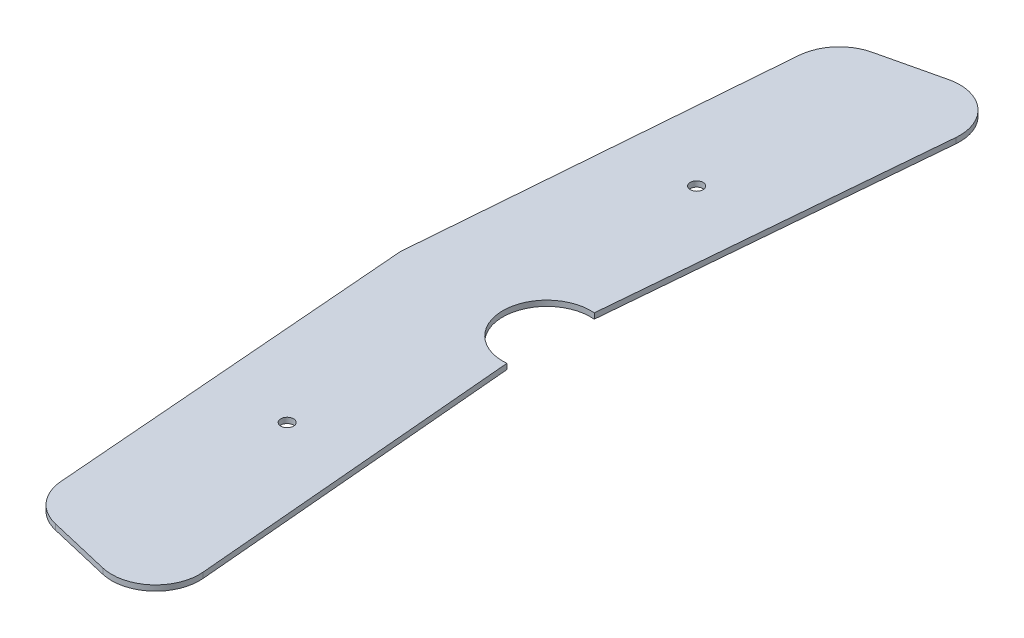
ISO-10303-21;
HEADER;
FILE_DESCRIPTION(('STEP AP214'),'2;1');
FILE_NAME('part.step','',(''),(''),'','','');
FILE_SCHEMA(('AUTOMOTIVE_DESIGN { 1 0 10303 214 1 1 1 1 }'));
ENDSEC;
DATA;
#1=APPLICATION_CONTEXT('core data for automotive mechanical design processes');
#2=APPLICATION_PROTOCOL_DEFINITION('international standard','automotive_design',2000,#1);
#3=PRODUCT_CONTEXT('',#1,'mechanical');
#4=PRODUCT('Part','Part','',(#3));
#5=PRODUCT_RELATED_PRODUCT_CATEGORY('part','',(#4));
#6=PRODUCT_DEFINITION_FORMATION('','',#4);
#7=PRODUCT_DEFINITION_CONTEXT('part definition',#1,'design');
#8=PRODUCT_DEFINITION('design','',#6,#7);
#9=PRODUCT_DEFINITION_SHAPE('','',#8);
#10=(LENGTH_UNIT() NAMED_UNIT(*) SI_UNIT(.MILLI.,.METRE.));
#11=(NAMED_UNIT(*) PLANE_ANGLE_UNIT() SI_UNIT($,.RADIAN.));
#12=(NAMED_UNIT(*) SI_UNIT($,.STERADIAN.) SOLID_ANGLE_UNIT());
#13=UNCERTAINTY_MEASURE_WITH_UNIT(LENGTH_MEASURE(1.E-05),#10,'distance_accuracy_value','');
#14=(GEOMETRIC_REPRESENTATION_CONTEXT(3) GLOBAL_UNCERTAINTY_ASSIGNED_CONTEXT((#13)) GLOBAL_UNIT_ASSIGNED_CONTEXT((#10,
#11,#12)) REPRESENTATION_CONTEXT('',''));
#15=CARTESIAN_POINT('',(0.,0.,0.));
#16=DIRECTION('',(0.,0.,1.));
#17=DIRECTION('',(1.,0.,0.));
#18=AXIS2_PLACEMENT_3D('',#15,#16,#17);
#19=CARTESIAN_POINT('',(20.,1.5,100.));
#20=DIRECTION('',(0.,-1.,0.));
#21=DIRECTION('',(0.,0.,-1.));
#22=AXIS2_PLACEMENT_3D('',#19,#20,#21);
#23=PLANE('',#22);
#24=CARTESIAN_POINT('',(25.,1.5,-56.));
#25=DIRECTION('',(0.,1.,0.));
#26=DIRECTION('',(0.,0.,1.));
#27=AXIS2_PLACEMENT_3D('',#24,#25,#26);
#28=CIRCLE('',#27,1.75);
#29=CARTESIAN_POINT('',(25.,1.5,-54.25));
#30=VERTEX_POINT('',#29);
#31=EDGE_CURVE('E132',#30,#30,#28,.T.);
#32=ORIENTED_EDGE('',*,*,#31,.F.);
#33=EDGE_LOOP('',(#32));
#34=FACE_BOUND('',#33,.T.);
#35=DIRECTION('',(0.0793688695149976,0.,0.996845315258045));
#36=VECTOR('',#35,1.);
#37=CARTESIAN_POINT('',(0.,1.5,0.));
#38=LINE('',#37,#36);
#39=CARTESIAN_POINT('',(0.,1.5,0.));
#40=VERTEX_POINT('',#39);
#41=CARTESIAN_POINT('',(8.03783692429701,1.5,100.952427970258));
#42=VERTEX_POINT('',#41);
#43=EDGE_CURVE('E156',#40,#42,#38,.T.);
#44=ORIENTED_EDGE('',*,*,#43,.T.);
#45=CARTESIAN_POINT('',(20.,1.5,100.));
#46=DIRECTION('',(0.,1.,0.));
#47=DIRECTION('',(0.,0.,-1.));
#48=AXIS2_PLACEMENT_3D('',#45,#46,#47);
#49=CIRCLE('',#48,12.0000193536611);
#50=CARTESIAN_POINT('',(17.2515962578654,1.5,111.681041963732));
#51=VERTEX_POINT('',#50);
#52=EDGE_CURVE('E127',#42,#51,#49,.T.);
#53=ORIENTED_EDGE('',*,*,#52,.T.);
#54=DIRECTION('',(0.973418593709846,0.,0.229033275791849));
#55=VECTOR('',#54,1.);
#56=CARTESIAN_POINT('',(17.2515962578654,1.5,111.681041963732));
#57=LINE('',#56,#55);
#58=CARTESIAN_POINT('',(34.2516211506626,1.5,115.680936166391));
#59=VERTEX_POINT('',#58);
#60=EDGE_CURVE('E159',#51,#59,#57,.T.);
#61=ORIENTED_EDGE('',*,*,#60,.T.);
#62=CARTESIAN_POINT('',(37.,1.5,104.));
#63=DIRECTION('',(0.,1.,0.));
#64=DIRECTION('',(0.,0.,-1.));
#65=AXIS2_PLACEMENT_3D('',#62,#63,#64);
#66=CIRCLE('',#65,11.9999106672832);
#67=CARTESIAN_POINT('',(48.9547808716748,1.5,102.960254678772));
#68=VERTEX_POINT('',#67);
#69=EDGE_CURVE('E161',#59,#68,#66,.T.);
#70=ORIENTED_EDGE('',*,*,#69,.T.);
#71=DIRECTION('',(-0.0866460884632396,0.,-0.996239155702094));
#72=VECTOR('',#71,1.);
#73=CARTESIAN_POINT('',(41.0397530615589,1.5,11.9548698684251));
#74=LINE('',#73,#72);
#75=CARTESIAN_POINT('',(41.0397530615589,1.5,11.9548698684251));
#76=VERTEX_POINT('',#75);
#77=EDGE_CURVE('E163',#68,#76,#74,.T.);
#78=ORIENTED_EDGE('',*,*,#77,.T.);
#79=CARTESIAN_POINT('',(40.,1.5,0.));
#80=DIRECTION('',(0.,-1.,0.));
#81=DIRECTION('',(0.,0.,1.));
#82=AXIS2_PLACEMENT_3D('',#79,#80,#81);
#83=CIRCLE('',#82,12.);
#84=CARTESIAN_POINT('',(41.0397530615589,1.5,-11.9548698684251));
#85=VERTEX_POINT('',#84);
#86=EDGE_CURVE('E165',#76,#85,#83,.T.);
#87=ORIENTED_EDGE('',*,*,#86,.T.);
#88=DIRECTION('',(0.0866460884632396,0.,-0.996239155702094));
#89=VECTOR('',#88,1.);
#90=CARTESIAN_POINT('',(41.0397530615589,1.5,-11.9548698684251));
#91=LINE('',#90,#89);
#92=CARTESIAN_POINT('',(48.9547808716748,1.5,-102.960254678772));
#93=VERTEX_POINT('',#92);
#94=EDGE_CURVE('E167',#85,#93,#91,.T.);
#95=ORIENTED_EDGE('',*,*,#94,.T.);
#96=CARTESIAN_POINT('',(37.,1.5,-104.));
#97=DIRECTION('',(0.,1.,0.));
#98=DIRECTION('',(0.,0.,1.));
#99=AXIS2_PLACEMENT_3D('',#96,#97,#98);
#100=CIRCLE('',#99,11.9999106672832);
#101=CARTESIAN_POINT('',(34.2516211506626,1.5,-115.680936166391));
#102=VERTEX_POINT('',#101);
#103=EDGE_CURVE('E169',#93,#102,#100,.T.);
#104=ORIENTED_EDGE('',*,*,#103,.T.);
#105=DIRECTION('',(-0.973418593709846,0.,0.229033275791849));
#106=VECTOR('',#105,1.);
#107=CARTESIAN_POINT('',(17.2515962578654,1.5,-111.681041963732));
#108=LINE('',#107,#106);
#109=CARTESIAN_POINT('',(17.2515962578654,1.5,-111.681041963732));
#110=VERTEX_POINT('',#109);
#111=EDGE_CURVE('E171',#102,#110,#108,.T.);
#112=ORIENTED_EDGE('',*,*,#111,.T.);
#113=CARTESIAN_POINT('',(20.,1.5,-100.));
#114=DIRECTION('',(0.,1.,0.));
#115=DIRECTION('',(0.,0.,1.));
#116=AXIS2_PLACEMENT_3D('',#113,#114,#115);
#117=CIRCLE('',#116,12.0000193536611);
#118=CARTESIAN_POINT('',(8.03783692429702,1.5,-100.952427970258));
#119=VERTEX_POINT('',#118);
#120=EDGE_CURVE('E50',#110,#119,#117,.T.);
#121=ORIENTED_EDGE('',*,*,#120,.T.);
#122=DIRECTION('',(-0.0793688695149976,0.,0.996845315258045));
#123=VECTOR('',#122,1.);
#124=CARTESIAN_POINT('',(0.,1.5,0.));
#125=LINE('',#124,#123);
#126=EDGE_CURVE('E45',#119,#40,#125,.T.);
#127=ORIENTED_EDGE('',*,*,#126,.T.);
#128=EDGE_LOOP('',(#44,#53,#61,#70,#78,#87,#95,#104,#112,#121,#127));
#129=FACE_BOUND('',#128,.T.);
#130=CARTESIAN_POINT('',(25.,1.5,56.));
#131=DIRECTION('',(0.,1.,0.));
#132=DIRECTION('',(0.,0.,-1.));
#133=AXIS2_PLACEMENT_3D('',#130,#131,#132);
#134=CIRCLE('',#133,1.75);
#135=CARTESIAN_POINT('',(25.,1.5,54.25));
#136=VERTEX_POINT('',#135);
#137=EDGE_CURVE('E266',#136,#136,#134,.T.);
#138=ORIENTED_EDGE('',*,*,#137,.F.);
#139=EDGE_LOOP('',(#138));
#140=FACE_BOUND('',#139,.T.);
#141=ADVANCED_FACE('F30',(#34,#129,#140),#23,.F.);
#142=CARTESIAN_POINT('',(20.,0.,100.));
#143=DIRECTION('',(0.,-1.,0.));
#144=DIRECTION('',(0.,0.,-1.));
#145=AXIS2_PLACEMENT_3D('',#142,#143,#144);
#146=PLANE('',#145);
#147=CARTESIAN_POINT('',(25.,0.,-56.));
#148=DIRECTION('',(0.,1.,0.));
#149=DIRECTION('',(0.,0.,1.));
#150=AXIS2_PLACEMENT_3D('',#147,#148,#149);
#151=CIRCLE('',#150,1.75);
#152=CARTESIAN_POINT('',(25.,0.,-54.25));
#153=VERTEX_POINT('',#152);
#154=EDGE_CURVE('E135',#153,#153,#151,.T.);
#155=ORIENTED_EDGE('',*,*,#154,.T.);
#156=EDGE_LOOP('',(#155));
#157=FACE_BOUND('',#156,.T.);
#158=DIRECTION('',(0.0793688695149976,0.,0.996845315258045));
#159=VECTOR('',#158,1.);
#160=CARTESIAN_POINT('',(0.,0.,0.));
#161=LINE('',#160,#159);
#162=CARTESIAN_POINT('',(0.,0.,0.));
#163=VERTEX_POINT('',#162);
#164=CARTESIAN_POINT('',(8.03783692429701,0.,100.952427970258));
#165=VERTEX_POINT('',#164);
#166=EDGE_CURVE('E118',#163,#165,#161,.T.);
#167=ORIENTED_EDGE('',*,*,#166,.F.);
#168=DIRECTION('',(-0.0793688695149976,0.,0.996845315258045));
#169=VECTOR('',#168,1.);
#170=CARTESIAN_POINT('',(0.,0.,0.));
#171=LINE('',#170,#169);
#172=CARTESIAN_POINT('',(8.03783692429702,0.,-100.952427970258));
#173=VERTEX_POINT('',#172);
#174=EDGE_CURVE('E154',#173,#163,#171,.T.);
#175=ORIENTED_EDGE('',*,*,#174,.F.);
#176=CARTESIAN_POINT('',(20.,0.,-100.));
#177=DIRECTION('',(0.,1.,0.));
#178=DIRECTION('',(0.,0.,1.));
#179=AXIS2_PLACEMENT_3D('',#176,#177,#178);
#180=CIRCLE('',#179,12.0000193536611);
#181=CARTESIAN_POINT('',(17.2515962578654,0.,-111.681041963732));
#182=VERTEX_POINT('',#181);
#183=EDGE_CURVE('E152',#182,#173,#180,.T.);
#184=ORIENTED_EDGE('',*,*,#183,.F.);
#185=DIRECTION('',(-0.973418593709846,0.,0.229033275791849));
#186=VECTOR('',#185,1.);
#187=CARTESIAN_POINT('',(17.2515962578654,0.,-111.681041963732));
#188=LINE('',#187,#186);
#189=CARTESIAN_POINT('',(34.2516211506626,0.,-115.680936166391));
#190=VERTEX_POINT('',#189);
#191=EDGE_CURVE('E150',#190,#182,#188,.T.);
#192=ORIENTED_EDGE('',*,*,#191,.F.);
#193=CARTESIAN_POINT('',(37.,0.,-104.));
#194=DIRECTION('',(0.,1.,0.));
#195=DIRECTION('',(0.,0.,1.));
#196=AXIS2_PLACEMENT_3D('',#193,#194,#195);
#197=CIRCLE('',#196,11.9999106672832);
#198=CARTESIAN_POINT('',(48.9547808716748,0.,-102.960254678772));
#199=VERTEX_POINT('',#198);
#200=EDGE_CURVE('E148',#199,#190,#197,.T.);
#201=ORIENTED_EDGE('',*,*,#200,.F.);
#202=DIRECTION('',(0.0866460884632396,0.,-0.996239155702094));
#203=VECTOR('',#202,1.);
#204=CARTESIAN_POINT('',(41.0397530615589,0.,-11.9548698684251));
#205=LINE('',#204,#203);
#206=CARTESIAN_POINT('',(41.0397530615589,0.,-11.9548698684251));
#207=VERTEX_POINT('',#206);
#208=EDGE_CURVE('E146',#207,#199,#205,.T.);
#209=ORIENTED_EDGE('',*,*,#208,.F.);
#210=CARTESIAN_POINT('',(40.,0.,0.));
#211=DIRECTION('',(0.,-1.,0.));
#212=DIRECTION('',(0.,0.,1.));
#213=AXIS2_PLACEMENT_3D('',#210,#211,#212);
#214=CIRCLE('',#213,12.);
#215=CARTESIAN_POINT('',(41.0397530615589,0.,11.9548698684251));
#216=VERTEX_POINT('',#215);
#217=EDGE_CURVE('E144',#216,#207,#214,.T.);
#218=ORIENTED_EDGE('',*,*,#217,.F.);
#219=DIRECTION('',(-0.0866460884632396,0.,-0.996239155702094));
#220=VECTOR('',#219,1.);
#221=CARTESIAN_POINT('',(41.0397530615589,0.,11.9548698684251));
#222=LINE('',#221,#220);
#223=CARTESIAN_POINT('',(48.9547808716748,0.,102.960254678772));
#224=VERTEX_POINT('',#223);
#225=EDGE_CURVE('E142',#224,#216,#222,.T.);
#226=ORIENTED_EDGE('',*,*,#225,.F.);
#227=CARTESIAN_POINT('',(37.,0.,104.));
#228=DIRECTION('',(0.,1.,0.));
#229=DIRECTION('',(0.,0.,-1.));
#230=AXIS2_PLACEMENT_3D('',#227,#228,#229);
#231=CIRCLE('',#230,11.9999106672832);
#232=CARTESIAN_POINT('',(34.2516211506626,0.,115.680936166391));
#233=VERTEX_POINT('',#232);
#234=EDGE_CURVE('E140',#233,#224,#231,.T.);
#235=ORIENTED_EDGE('',*,*,#234,.F.);
#236=DIRECTION('',(0.973418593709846,0.,0.229033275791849));
#237=VECTOR('',#236,1.);
#238=CARTESIAN_POINT('',(17.2515962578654,0.,111.681041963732));
#239=LINE('',#238,#237);
#240=CARTESIAN_POINT('',(17.2515962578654,0.,111.681041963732));
#241=VERTEX_POINT('',#240);
#242=EDGE_CURVE('E120',#241,#233,#239,.T.);
#243=ORIENTED_EDGE('',*,*,#242,.F.);
#244=CARTESIAN_POINT('',(20.,0.,100.));
#245=DIRECTION('',(0.,1.,0.));
#246=DIRECTION('',(0.,0.,-1.));
#247=AXIS2_PLACEMENT_3D('',#244,#245,#246);
#248=CIRCLE('',#247,12.0000193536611);
#249=EDGE_CURVE('E113',#165,#241,#248,.T.);
#250=ORIENTED_EDGE('',*,*,#249,.F.);
#251=EDGE_LOOP('',(#167,#175,#184,#192,#201,#209,#218,#226,#235,#243,#250));
#252=FACE_BOUND('',#251,.T.);
#253=CARTESIAN_POINT('',(25.,0.,56.));
#254=DIRECTION('',(0.,1.,0.));
#255=DIRECTION('',(0.,0.,-1.));
#256=AXIS2_PLACEMENT_3D('',#253,#254,#255);
#257=CIRCLE('',#256,1.75);
#258=CARTESIAN_POINT('',(25.,0.,54.25));
#259=VERTEX_POINT('',#258);
#260=EDGE_CURVE('E269',#259,#259,#257,.T.);
#261=ORIENTED_EDGE('',*,*,#260,.T.);
#262=EDGE_LOOP('',(#261));
#263=FACE_BOUND('',#262,.T.);
#264=ADVANCED_FACE('F114',(#157,#252,#263),#146,.T.);
#265=CARTESIAN_POINT('',(0.,1.5,0.));
#266=DIRECTION('',(0.996845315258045,0.,-0.0793688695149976));
#267=DIRECTION('',(-0.0793688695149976,0.,-0.996845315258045));
#268=AXIS2_PLACEMENT_3D('',#265,#266,#267);
#269=PLANE('',#268);
#270=ORIENTED_EDGE('',*,*,#166,.T.);
#271=DIRECTION('',(0.,-1.,0.));
#272=VECTOR('',#271,1.);
#273=CARTESIAN_POINT('',(8.03783692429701,1.5,100.952427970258));
#274=LINE('',#273,#272);
#275=EDGE_CURVE('E11',#42,#165,#274,.T.);
#276=ORIENTED_EDGE('',*,*,#275,.F.);
#277=ORIENTED_EDGE('',*,*,#43,.F.);
#278=DIRECTION('',(0.,-1.,0.));
#279=VECTOR('',#278,1.);
#280=CARTESIAN_POINT('',(0.,1.5,0.));
#281=LINE('',#280,#279);
#282=EDGE_CURVE('E131',#40,#163,#281,.T.);
#283=ORIENTED_EDGE('',*,*,#282,.T.);
#284=EDGE_LOOP('',(#270,#276,#277,#283));
#285=FACE_BOUND('',#284,.T.);
#286=ADVANCED_FACE('F32',(#285),#269,.F.);
#287=CARTESIAN_POINT('',(20.,1.5,100.));
#288=DIRECTION('',(0.,-1.,0.));
#289=DIRECTION('',(0.,0.,-1.));
#290=AXIS2_PLACEMENT_3D('',#287,#288,#289);
#291=CYLINDRICAL_SURFACE('',#290,12.0000193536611);
#292=ORIENTED_EDGE('',*,*,#249,.T.);
#293=DIRECTION('',(0.,-1.,0.));
#294=VECTOR('',#293,1.);
#295=CARTESIAN_POINT('',(17.2515962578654,1.5,111.681041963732));
#296=LINE('',#295,#294);
#297=EDGE_CURVE('E38',#51,#241,#296,.T.);
#298=ORIENTED_EDGE('',*,*,#297,.F.);
#299=ORIENTED_EDGE('',*,*,#52,.F.);
#300=ORIENTED_EDGE('',*,*,#275,.T.);
#301=EDGE_LOOP('',(#292,#298,#299,#300));
#302=FACE_BOUND('',#301,.T.);
#303=ADVANCED_FACE('F126',(#302),#291,.T.);
#304=CARTESIAN_POINT('',(17.2515962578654,1.5,111.681041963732));
#305=DIRECTION('',(0.229033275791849,0.,-0.973418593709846));
#306=DIRECTION('',(-0.973418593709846,0.,-0.229033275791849));
#307=AXIS2_PLACEMENT_3D('',#304,#305,#306);
#308=PLANE('',#307);
#309=ORIENTED_EDGE('',*,*,#242,.T.);
#310=DIRECTION('',(0.,-1.,0.));
#311=VECTOR('',#310,1.);
#312=CARTESIAN_POINT('',(34.2516211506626,1.5,115.680936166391));
#313=LINE('',#312,#311);
#314=EDGE_CURVE('E197',#59,#233,#313,.T.);
#315=ORIENTED_EDGE('',*,*,#314,.F.);
#316=ORIENTED_EDGE('',*,*,#60,.F.);
#317=ORIENTED_EDGE('',*,*,#297,.T.);
#318=EDGE_LOOP('',(#309,#315,#316,#317));
#319=FACE_BOUND('',#318,.T.);
#320=ADVANCED_FACE('F201',(#319),#308,.F.);
#321=CARTESIAN_POINT('',(37.,1.5,104.));
#322=DIRECTION('',(0.,-1.,0.));
#323=DIRECTION('',(0.,0.,-1.));
#324=AXIS2_PLACEMENT_3D('',#321,#322,#323);
#325=CYLINDRICAL_SURFACE('',#324,11.9999106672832);
#326=ORIENTED_EDGE('',*,*,#234,.T.);
#327=DIRECTION('',(0.,-1.,0.));
#328=VECTOR('',#327,1.);
#329=CARTESIAN_POINT('',(48.9547808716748,1.5,102.960254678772));
#330=LINE('',#329,#328);
#331=EDGE_CURVE('E194',#68,#224,#330,.T.);
#332=ORIENTED_EDGE('',*,*,#331,.F.);
#333=ORIENTED_EDGE('',*,*,#69,.F.);
#334=ORIENTED_EDGE('',*,*,#314,.T.);
#335=EDGE_LOOP('',(#326,#332,#333,#334));
#336=FACE_BOUND('',#335,.T.);
#337=ADVANCED_FACE('F209',(#336),#325,.T.);
#338=CARTESIAN_POINT('',(41.0397530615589,1.5,11.9548698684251));
#339=DIRECTION('',(-0.996239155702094,0.,0.0866460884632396));
#340=DIRECTION('',(0.0866460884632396,0.,0.996239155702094));
#341=AXIS2_PLACEMENT_3D('',#338,#339,#340);
#342=PLANE('',#341);
#343=ORIENTED_EDGE('',*,*,#225,.T.);
#344=DIRECTION('',(0.,-1.,0.));
#345=VECTOR('',#344,1.);
#346=CARTESIAN_POINT('',(41.0397530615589,1.5,11.9548698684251));
#347=LINE('',#346,#345);
#348=EDGE_CURVE('E191',#76,#216,#347,.T.);
#349=ORIENTED_EDGE('',*,*,#348,.F.);
#350=ORIENTED_EDGE('',*,*,#77,.F.);
#351=ORIENTED_EDGE('',*,*,#331,.T.);
#352=EDGE_LOOP('',(#343,#349,#350,#351));
#353=FACE_BOUND('',#352,.T.);
#354=ADVANCED_FACE('F212',(#353),#342,.F.);
#355=CARTESIAN_POINT('',(40.,1.5,0.));
#356=DIRECTION('',(0.,-1.,0.));
#357=DIRECTION('',(0.,0.,-1.));
#358=AXIS2_PLACEMENT_3D('',#355,#356,#357);
#359=CYLINDRICAL_SURFACE('',#358,12.);
#360=ORIENTED_EDGE('',*,*,#217,.T.);
#361=DIRECTION('',(0.,-1.,0.));
#362=VECTOR('',#361,1.);
#363=CARTESIAN_POINT('',(41.0397530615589,1.5,-11.9548698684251));
#364=LINE('',#363,#362);
#365=EDGE_CURVE('E188',#85,#207,#364,.T.);
#366=ORIENTED_EDGE('',*,*,#365,.F.);
#367=ORIENTED_EDGE('',*,*,#86,.F.);
#368=ORIENTED_EDGE('',*,*,#348,.T.);
#369=EDGE_LOOP('',(#360,#366,#367,#368));
#370=FACE_BOUND('',#369,.T.);
#371=ADVANCED_FACE('F217',(#370),#359,.F.);
#372=CARTESIAN_POINT('',(41.0397530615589,1.5,-11.9548698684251));
#373=DIRECTION('',(-0.996239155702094,0.,-0.0866460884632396));
#374=DIRECTION('',(-0.0866460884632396,0.,0.996239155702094));
#375=AXIS2_PLACEMENT_3D('',#372,#373,#374);
#376=PLANE('',#375);
#377=ORIENTED_EDGE('',*,*,#208,.T.);
#378=DIRECTION('',(0.,-1.,0.));
#379=VECTOR('',#378,1.);
#380=CARTESIAN_POINT('',(48.9547808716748,1.5,-102.960254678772));
#381=LINE('',#380,#379);
#382=EDGE_CURVE('E185',#93,#199,#381,.T.);
#383=ORIENTED_EDGE('',*,*,#382,.F.);
#384=ORIENTED_EDGE('',*,*,#94,.F.);
#385=ORIENTED_EDGE('',*,*,#365,.T.);
#386=EDGE_LOOP('',(#377,#383,#384,#385));
#387=FACE_BOUND('',#386,.T.);
#388=ADVANCED_FACE('F223',(#387),#376,.F.);
#389=CARTESIAN_POINT('',(37.,1.5,-104.));
#390=DIRECTION('',(0.,-1.,0.));
#391=DIRECTION('',(0.,0.,-1.));
#392=AXIS2_PLACEMENT_3D('',#389,#390,#391);
#393=CYLINDRICAL_SURFACE('',#392,11.9999106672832);
#394=ORIENTED_EDGE('',*,*,#200,.T.);
#395=DIRECTION('',(0.,-1.,0.));
#396=VECTOR('',#395,1.);
#397=CARTESIAN_POINT('',(34.2516211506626,1.5,-115.680936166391));
#398=LINE('',#397,#396);
#399=EDGE_CURVE('E182',#102,#190,#398,.T.);
#400=ORIENTED_EDGE('',*,*,#399,.F.);
#401=ORIENTED_EDGE('',*,*,#103,.F.);
#402=ORIENTED_EDGE('',*,*,#382,.T.);
#403=EDGE_LOOP('',(#394,#400,#401,#402));
#404=FACE_BOUND('',#403,.T.);
#405=ADVANCED_FACE('F227',(#404),#393,.T.);
#406=CARTESIAN_POINT('',(17.2515962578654,1.5,-111.681041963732));
#407=DIRECTION('',(0.229033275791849,0.,0.973418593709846));
#408=DIRECTION('',(0.973418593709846,0.,-0.229033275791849));
#409=AXIS2_PLACEMENT_3D('',#406,#407,#408);
#410=PLANE('',#409);
#411=ORIENTED_EDGE('',*,*,#191,.T.);
#412=DIRECTION('',(0.,-1.,0.));
#413=VECTOR('',#412,1.);
#414=CARTESIAN_POINT('',(17.2515962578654,1.5,-111.681041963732));
#415=LINE('',#414,#413);
#416=EDGE_CURVE('E179',#110,#182,#415,.T.);
#417=ORIENTED_EDGE('',*,*,#416,.F.);
#418=ORIENTED_EDGE('',*,*,#111,.F.);
#419=ORIENTED_EDGE('',*,*,#399,.T.);
#420=EDGE_LOOP('',(#411,#417,#418,#419));
#421=FACE_BOUND('',#420,.T.);
#422=ADVANCED_FACE('F232',(#421),#410,.F.);
#423=CARTESIAN_POINT('',(20.,1.5,-100.));
#424=DIRECTION('',(0.,-1.,0.));
#425=DIRECTION('',(0.,0.,-1.));
#426=AXIS2_PLACEMENT_3D('',#423,#424,#425);
#427=CYLINDRICAL_SURFACE('',#426,12.0000193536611);
#428=ORIENTED_EDGE('',*,*,#183,.T.);
#429=DIRECTION('',(0.,-1.,0.));
#430=VECTOR('',#429,1.);
#431=CARTESIAN_POINT('',(8.03783692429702,1.5,-100.952427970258));
#432=LINE('',#431,#430);
#433=EDGE_CURVE('E176',#119,#173,#432,.T.);
#434=ORIENTED_EDGE('',*,*,#433,.F.);
#435=ORIENTED_EDGE('',*,*,#120,.F.);
#436=ORIENTED_EDGE('',*,*,#416,.T.);
#437=EDGE_LOOP('',(#428,#434,#435,#436));
#438=FACE_BOUND('',#437,.T.);
#439=ADVANCED_FACE('F235',(#438),#427,.T.);
#440=CARTESIAN_POINT('',(0.,1.5,0.));
#441=DIRECTION('',(0.996845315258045,0.,0.0793688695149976));
#442=DIRECTION('',(0.0793688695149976,0.,-0.996845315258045));
#443=AXIS2_PLACEMENT_3D('',#440,#441,#442);
#444=PLANE('',#443);
#445=ORIENTED_EDGE('',*,*,#174,.T.);
#446=ORIENTED_EDGE('',*,*,#282,.F.);
#447=ORIENTED_EDGE('',*,*,#126,.F.);
#448=ORIENTED_EDGE('',*,*,#433,.T.);
#449=EDGE_LOOP('',(#445,#446,#447,#448));
#450=FACE_BOUND('',#449,.T.);
#451=ADVANCED_FACE('F237',(#450),#444,.F.);
#452=CARTESIAN_POINT('',(25.,1.5,-56.));
#453=DIRECTION('',(0.,-1.,0.));
#454=DIRECTION('',(0.,0.,-1.));
#455=AXIS2_PLACEMENT_3D('',#452,#453,#454);
#456=CYLINDRICAL_SURFACE('',#455,1.75);
#457=ORIENTED_EDGE('',*,*,#31,.T.);
#458=EDGE_LOOP('',(#457));
#459=FACE_BOUND('',#458,.T.);
#460=ORIENTED_EDGE('',*,*,#154,.F.);
#461=EDGE_LOOP('',(#460));
#462=FACE_BOUND('',#461,.T.);
#463=ADVANCED_FACE('F239',(#459,#462),#456,.F.);
#464=CARTESIAN_POINT('',(25.,1.5,56.));
#465=DIRECTION('',(0.,-1.,0.));
#466=DIRECTION('',(0.,0.,-1.));
#467=AXIS2_PLACEMENT_3D('',#464,#465,#466);
#468=CYLINDRICAL_SURFACE('',#467,1.75);
#469=ORIENTED_EDGE('',*,*,#137,.T.);
#470=EDGE_LOOP('',(#469));
#471=FACE_BOUND('',#470,.T.);
#472=ORIENTED_EDGE('',*,*,#260,.F.);
#473=EDGE_LOOP('',(#472));
#474=FACE_BOUND('',#473,.T.);
#475=ADVANCED_FACE('F245',(#471,#474),#468,.F.);
#476=CLOSED_SHELL('',(#141,#264,#286,#303,#320,#337,#354,#371,#388,#405,#422,#439,#451,#463,#475));
#477=MANIFOLD_SOLID_BREP('B2',#476);
#478=ADVANCED_BREP_SHAPE_REPRESENTATION('',(#18,#477),#14);
#479=SHAPE_DEFINITION_REPRESENTATION(#9,#478);
ENDSEC;
END-ISO-10303-21;
